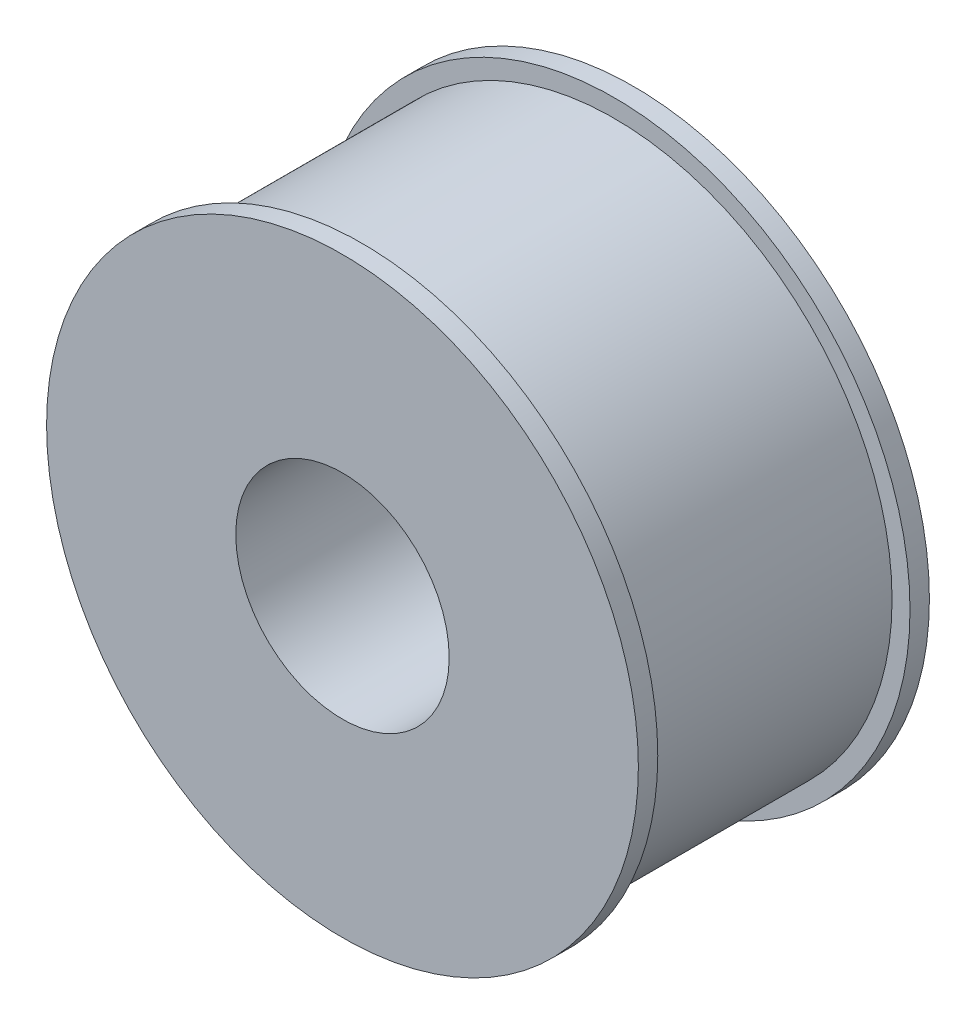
ISO-10303-21;
HEADER;
FILE_DESCRIPTION(('STEP AP214'),'2;1');
FILE_NAME('part.step','',(''),(''),'','','');
FILE_SCHEMA(('AUTOMOTIVE_DESIGN { 1 0 10303 214 1 1 1 1 }'));
ENDSEC;
DATA;
#1=APPLICATION_CONTEXT('core data for automotive mechanical design processes');
#2=APPLICATION_PROTOCOL_DEFINITION('international standard','automotive_design',2000,#1);
#3=PRODUCT_CONTEXT('',#1,'mechanical');
#4=PRODUCT('Part','Part','',(#3));
#5=PRODUCT_RELATED_PRODUCT_CATEGORY('part','',(#4));
#6=PRODUCT_DEFINITION_FORMATION('','',#4);
#7=PRODUCT_DEFINITION_CONTEXT('part definition',#1,'design');
#8=PRODUCT_DEFINITION('design','',#6,#7);
#9=PRODUCT_DEFINITION_SHAPE('','',#8);
#10=(LENGTH_UNIT() NAMED_UNIT(*) SI_UNIT(.MILLI.,.METRE.));
#11=(NAMED_UNIT(*) PLANE_ANGLE_UNIT() SI_UNIT($,.RADIAN.));
#12=(NAMED_UNIT(*) SI_UNIT($,.STERADIAN.) SOLID_ANGLE_UNIT());
#13=UNCERTAINTY_MEASURE_WITH_UNIT(LENGTH_MEASURE(1.E-05),#10,'distance_accuracy_value','');
#14=(GEOMETRIC_REPRESENTATION_CONTEXT(3) GLOBAL_UNCERTAINTY_ASSIGNED_CONTEXT((#13)) GLOBAL_UNIT_ASSIGNED_CONTEXT((#10,
#11,#12)) REPRESENTATION_CONTEXT('',''));
#15=CARTESIAN_POINT('',(0.,0.,0.));
#16=DIRECTION('',(0.,0.,1.));
#17=DIRECTION('',(1.,0.,0.));
#18=AXIS2_PLACEMENT_3D('',#15,#16,#17);
#19=CARTESIAN_POINT('',(0.,0.,0.));
#20=DIRECTION('',(0.,0.,-1.));
#21=DIRECTION('',(-1.,0.,0.));
#22=AXIS2_PLACEMENT_3D('',#19,#20,#21);
#23=PLANE('',#22);
#24=CARTESIAN_POINT('',(0.,0.,0.));
#25=DIRECTION('',(0.,0.,-1.));
#26=DIRECTION('',(-1.,0.,0.));
#27=AXIS2_PLACEMENT_3D('',#24,#25,#26);
#28=CIRCLE('',#27,11.);
#29=CARTESIAN_POINT('',(-11.,0.,0.));
#30=VERTEX_POINT('',#29);
#31=EDGE_CURVE('E70',#30,#30,#28,.T.);
#32=ORIENTED_EDGE('',*,*,#31,.T.);
#33=EDGE_LOOP('',(#32));
#34=FACE_BOUND('',#33,.T.);
#35=CARTESIAN_POINT('',(0.,0.,0.));
#36=DIRECTION('',(0.,0.,1.));
#37=DIRECTION('',(1.,0.,0.));
#38=AXIS2_PLACEMENT_3D('',#35,#36,#37);
#39=CIRCLE('',#38,30.5);
#40=CARTESIAN_POINT('',(30.5,0.,0.));
#41=VERTEX_POINT('',#40);
#42=EDGE_CURVE('E10',#41,#41,#39,.T.);
#43=ORIENTED_EDGE('',*,*,#42,.T.);
#44=EDGE_LOOP('',(#43));
#45=FACE_BOUND('',#44,.T.);
#46=ADVANCED_FACE('F34',(#34,#45),#23,.F.);
#47=CARTESIAN_POINT('',(0.,0.,18.1621621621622));
#48=DIRECTION('',(0.,0.,1.));
#49=DIRECTION('',(1.,0.,0.));
#50=AXIS2_PLACEMENT_3D('',#47,#48,#49);
#51=CYLINDRICAL_SURFACE('',#50,30.5);
#52=ORIENTED_EDGE('',*,*,#42,.F.);
#53=EDGE_LOOP('',(#52));
#54=FACE_BOUND('',#53,.T.);
#55=CARTESIAN_POINT('',(0.,0.,-2.));
#56=DIRECTION('',(0.,0.,1.));
#57=DIRECTION('',(1.,0.,0.));
#58=AXIS2_PLACEMENT_3D('',#55,#56,#57);
#59=CIRCLE('',#58,30.5);
#60=CARTESIAN_POINT('',(30.5,0.,-2.));
#61=VERTEX_POINT('',#60);
#62=EDGE_CURVE('E46',#61,#61,#59,.T.);
#63=ORIENTED_EDGE('',*,*,#62,.T.);
#64=EDGE_LOOP('',(#63));
#65=FACE_BOUND('',#64,.T.);
#66=ADVANCED_FACE('F106',(#54,#65),#51,.T.);
#67=CARTESIAN_POINT('',(0.,30.5,-2.));
#68=DIRECTION('',(0.,0.,1.));
#69=DIRECTION('',(1.,0.,0.));
#70=AXIS2_PLACEMENT_3D('',#67,#68,#69);
#71=PLANE('',#70);
#72=ORIENTED_EDGE('',*,*,#62,.F.);
#73=EDGE_LOOP('',(#72));
#74=FACE_BOUND('',#73,.T.);
#75=CARTESIAN_POINT('',(0.,0.,-2.));
#76=DIRECTION('',(0.,0.,1.));
#77=DIRECTION('',(1.,0.,0.));
#78=AXIS2_PLACEMENT_3D('',#75,#76,#77);
#79=CIRCLE('',#78,28.65);
#80=CARTESIAN_POINT('',(28.65,0.,-2.));
#81=VERTEX_POINT('',#80);
#82=EDGE_CURVE('E50',#81,#81,#79,.T.);
#83=ORIENTED_EDGE('',*,*,#82,.T.);
#84=EDGE_LOOP('',(#83));
#85=FACE_BOUND('',#84,.T.);
#86=ADVANCED_FACE('F111',(#74,#85),#71,.F.);
#87=CARTESIAN_POINT('',(0.,0.,18.1621621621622));
#88=DIRECTION('',(0.,0.,1.));
#89=DIRECTION('',(1.,0.,0.));
#90=AXIS2_PLACEMENT_3D('',#87,#88,#89);
#91=CYLINDRICAL_SURFACE('',#90,28.65);
#92=ORIENTED_EDGE('',*,*,#82,.F.);
#93=EDGE_LOOP('',(#92));
#94=FACE_BOUND('',#93,.T.);
#95=CARTESIAN_POINT('',(0.,0.,-28.));
#96=DIRECTION('',(0.,0.,1.));
#97=DIRECTION('',(1.,0.,0.));
#98=AXIS2_PLACEMENT_3D('',#95,#96,#97);
#99=CIRCLE('',#98,28.65);
#100=CARTESIAN_POINT('',(28.65,0.,-28.));
#101=VERTEX_POINT('',#100);
#102=EDGE_CURVE('E55',#101,#101,#99,.T.);
#103=ORIENTED_EDGE('',*,*,#102,.T.);
#104=EDGE_LOOP('',(#103));
#105=FACE_BOUND('',#104,.T.);
#106=ADVANCED_FACE('F119',(#94,#105),#91,.T.);
#107=CARTESIAN_POINT('',(0.,28.65,-28.));
#108=DIRECTION('',(0.,0.,-1.));
#109=DIRECTION('',(-1.,0.,0.));
#110=AXIS2_PLACEMENT_3D('',#107,#108,#109);
#111=PLANE('',#110);
#112=ORIENTED_EDGE('',*,*,#102,.F.);
#113=EDGE_LOOP('',(#112));
#114=FACE_BOUND('',#113,.T.);
#115=CARTESIAN_POINT('',(0.,0.,-28.));
#116=DIRECTION('',(0.,0.,1.));
#117=DIRECTION('',(1.,0.,0.));
#118=AXIS2_PLACEMENT_3D('',#115,#116,#117);
#119=CIRCLE('',#118,30.5);
#120=CARTESIAN_POINT('',(30.5,0.,-28.));
#121=VERTEX_POINT('',#120);
#122=EDGE_CURVE('E58',#121,#121,#119,.T.);
#123=ORIENTED_EDGE('',*,*,#122,.T.);
#124=EDGE_LOOP('',(#123));
#125=FACE_BOUND('',#124,.T.);
#126=ADVANCED_FACE('F126',(#114,#125),#111,.F.);
#127=CARTESIAN_POINT('',(0.,0.,18.1621621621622));
#128=DIRECTION('',(0.,0.,1.));
#129=DIRECTION('',(1.,0.,0.));
#130=AXIS2_PLACEMENT_3D('',#127,#128,#129);
#131=CYLINDRICAL_SURFACE('',#130,30.5);
#132=ORIENTED_EDGE('',*,*,#122,.F.);
#133=EDGE_LOOP('',(#132));
#134=FACE_BOUND('',#133,.T.);
#135=CARTESIAN_POINT('',(0.,0.,-30.));
#136=DIRECTION('',(0.,0.,1.));
#137=DIRECTION('',(1.,0.,0.));
#138=AXIS2_PLACEMENT_3D('',#135,#136,#137);
#139=CIRCLE('',#138,30.5);
#140=CARTESIAN_POINT('',(30.5,0.,-30.));
#141=VERTEX_POINT('',#140);
#142=EDGE_CURVE('E61',#141,#141,#139,.T.);
#143=ORIENTED_EDGE('',*,*,#142,.T.);
#144=EDGE_LOOP('',(#143));
#145=FACE_BOUND('',#144,.T.);
#146=ADVANCED_FACE('F130',(#134,#145),#131,.T.);
#147=CARTESIAN_POINT('',(0.,30.5,-30.));
#148=DIRECTION('',(0.,0.,1.));
#149=DIRECTION('',(1.,0.,0.));
#150=AXIS2_PLACEMENT_3D('',#147,#148,#149);
#151=PLANE('',#150);
#152=ORIENTED_EDGE('',*,*,#142,.F.);
#153=EDGE_LOOP('',(#152));
#154=FACE_BOUND('',#153,.T.);
#155=CARTESIAN_POINT('',(0.,0.,-30.));
#156=DIRECTION('',(0.,0.,1.));
#157=DIRECTION('',(1.,0.,0.));
#158=AXIS2_PLACEMENT_3D('',#155,#156,#157);
#159=CIRCLE('',#158,19.);
#160=CARTESIAN_POINT('',(19.,0.,-30.));
#161=VERTEX_POINT('',#160);
#162=EDGE_CURVE('E64',#161,#161,#159,.T.);
#163=ORIENTED_EDGE('',*,*,#162,.T.);
#164=EDGE_LOOP('',(#163));
#165=FACE_BOUND('',#164,.T.);
#166=ADVANCED_FACE('F101',(#154,#165),#151,.F.);
#167=CARTESIAN_POINT('',(0.,0.,18.1621621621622));
#168=DIRECTION('',(0.,0.,1.));
#169=DIRECTION('',(1.,0.,0.));
#170=AXIS2_PLACEMENT_3D('',#167,#168,#169);
#171=CYLINDRICAL_SURFACE('',#170,19.);
#172=CARTESIAN_POINT('',(-19.,0.,-35.1));
#173=CARTESIAN_POINT('',(-18.9999985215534,0.11757322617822,-35.0999949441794));
#174=CARTESIAN_POINT('',(-18.9988971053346,0.235222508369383,-35.0900928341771));
#175=CARTESIAN_POINT('',(-18.9946092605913,0.467254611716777,-35.0507435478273));
#176=CARTESIAN_POINT('',(-18.9914205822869,0.581633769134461,-35.0212752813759));
#177=CARTESIAN_POINT('',(-18.9833178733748,0.803732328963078,-34.943666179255));
#178=CARTESIAN_POINT('',(-18.9784049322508,0.911455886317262,-34.8955371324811));
#179=CARTESIAN_POINT('',(-18.9674018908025,1.11727389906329,-34.7819967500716));
#180=CARTESIAN_POINT('',(-18.9613120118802,1.21537016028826,-34.7165886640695));
#181=CARTESIAN_POINT('',(-18.9486067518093,1.39959820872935,-34.5700419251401));
#182=CARTESIAN_POINT('',(-18.9419894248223,1.48568213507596,-34.4888432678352));
#183=CARTESIAN_POINT('',(-18.9289910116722,1.64303018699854,-34.3131487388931));
#184=CARTESIAN_POINT('',(-18.9226099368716,1.71429360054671,-34.2186522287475));
#185=CARTESIAN_POINT('',(-18.9107869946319,1.84015104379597,-34.0187398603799));
#186=CARTESIAN_POINT('',(-18.9053476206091,1.89470110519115,-33.9132961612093));
#187=CARTESIAN_POINT('',(-18.8960487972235,1.98530261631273,-33.6946749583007));
#188=CARTESIAN_POINT('',(-18.8921893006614,2.02135461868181,-33.5814976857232));
#189=CARTESIAN_POINT('',(-18.8865052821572,2.07379318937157,-33.3511140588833));
#190=CARTESIAN_POINT('',(-18.8846724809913,2.09025978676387,-33.2339261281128));
#191=CARTESIAN_POINT('',(-18.8832238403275,2.10330760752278,-32.9984367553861));
#192=CARTESIAN_POINT('',(-18.8836079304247,2.09988946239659,-32.8801353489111));
#193=CARTESIAN_POINT('',(-18.886542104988,2.0733306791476,-32.6463312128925));
#194=CARTESIAN_POINT('',(-18.8890825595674,2.05027772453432,-32.5308183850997));
#195=CARTESIAN_POINT('',(-18.8960281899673,1.98524029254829,-32.3053112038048));
#196=CARTESIAN_POINT('',(-18.9004333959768,1.94325550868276,-32.1953169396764));
#197=CARTESIAN_POINT('',(-18.9106232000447,1.84145043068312,-31.9836940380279));
#198=CARTESIAN_POINT('',(-18.9164107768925,1.78159155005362,-31.8820841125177));
#199=CARTESIAN_POINT('',(-18.928710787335,1.64576512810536,-31.6903190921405));
#200=CARTESIAN_POINT('',(-18.9352232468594,1.56979701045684,-31.6001644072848));
#201=CARTESIAN_POINT('',(-18.9482821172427,1.40342032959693,-31.4333597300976));
#202=CARTESIAN_POINT('',(-18.9548285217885,1.31293609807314,-31.3567851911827));
#203=CARTESIAN_POINT('',(-18.9671846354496,1.12035757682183,-31.2199003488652));
#204=CARTESIAN_POINT('',(-18.9729943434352,1.01826326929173,-31.1595900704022));
#205=CARTESIAN_POINT('',(-18.9832250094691,0.805308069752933,-31.0569475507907));
#206=CARTESIAN_POINT('',(-18.9876456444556,0.694445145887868,-31.0146194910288));
#207=CARTESIAN_POINT('',(-18.9945969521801,0.467125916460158,-30.9492000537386));
#208=CARTESIAN_POINT('',(-18.9971276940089,0.350669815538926,-30.9261079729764));
#209=CARTESIAN_POINT('',(-19.0000051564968,0.116123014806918,-30.8999125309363));
#210=CARTESIAN_POINT('',(-19.0003632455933,-0.00195593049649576,-30.8967051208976));
#211=CARTESIAN_POINT('',(-18.9988856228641,-0.236969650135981,-30.9100962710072));
#212=CARTESIAN_POINT('',(-18.997049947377,-0.353904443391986,-30.9266945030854));
#213=CARTESIAN_POINT('',(-18.9913982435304,-0.583007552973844,-30.9791394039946));
#214=CARTESIAN_POINT('',(-18.9875872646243,-0.695187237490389,-31.0149370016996));
#215=CARTESIAN_POINT('',(-18.9784121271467,-0.911950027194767,-31.1047138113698));
#216=CARTESIAN_POINT('',(-18.9730479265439,-1.0165329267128,-31.1586935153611));
#217=CARTESIAN_POINT('',(-18.9613372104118,-1.21560160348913,-31.2835578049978));
#218=CARTESIAN_POINT('',(-18.9549867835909,-1.31004452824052,-31.3545103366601));
#219=CARTESIAN_POINT('',(-18.9420277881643,-1.48571772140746,-31.5112092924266));
#220=CARTESIAN_POINT('',(-18.9354192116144,-1.56694758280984,-31.5969561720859));
#221=CARTESIAN_POINT('',(-18.9226541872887,-1.71425322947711,-31.7812655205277));
#222=CARTESIAN_POINT('',(-18.9164998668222,-1.78026045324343,-31.8798829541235));
#223=CARTESIAN_POINT('',(-18.9053736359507,-1.89477488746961,-32.0868646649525));
#224=CARTESIAN_POINT('',(-18.9004017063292,-1.94328238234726,-32.19522878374));
#225=CARTESIAN_POINT('',(-18.8922170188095,-2.02130711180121,-32.4183981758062));
#226=CARTESIAN_POINT('',(-18.8890005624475,-2.05086429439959,-32.5331893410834));
#227=CARTESIAN_POINT('',(-18.8846798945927,-2.09027863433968,-32.7661429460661));
#228=CARTESIAN_POINT('',(-18.883575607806,-2.1001364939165,-32.8843052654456));
#229=CARTESIAN_POINT('',(-18.8836061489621,-2.09986138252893,-33.1199653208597));
#230=CARTESIAN_POINT('',(-18.884728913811,-2.08983611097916,-33.2374631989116));
#231=CARTESIAN_POINT('',(-18.8890612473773,-2.05030602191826,-33.4690940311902));
#232=CARTESIAN_POINT('',(-18.8922708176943,-2.02080118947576,-33.5832269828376));
#233=CARTESIAN_POINT('',(-18.9004116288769,-1.94318083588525,-33.804881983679));
#234=CARTESIAN_POINT('',(-18.9053425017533,-1.89506929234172,-33.9124054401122));
#235=CARTESIAN_POINT('',(-18.9163710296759,-1.78161203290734,-34.117869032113));
#236=CARTESIAN_POINT('',(-18.9224686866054,-1.71626628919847,-34.2158091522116));
#237=CARTESIAN_POINT('',(-18.9351833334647,-1.56979267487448,-34.399877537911));
#238=CARTESIAN_POINT('',(-18.9418028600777,-1.48858446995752,-34.4859417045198));
#239=CARTESIAN_POINT('',(-18.9547924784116,-1.31285475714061,-34.6432655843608));
#240=CARTESIAN_POINT('',(-18.961162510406,-1.21833008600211,-34.7145217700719));
#241=CARTESIAN_POINT('',(-18.9729559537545,-1.01833180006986,-34.8403824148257));
#242=CARTESIAN_POINT('',(-18.9783764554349,-0.912826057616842,-34.8949360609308));
#243=CARTESIAN_POINT('',(-18.9876295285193,-0.694155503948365,-34.9854776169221));
#244=CARTESIAN_POINT('',(-18.9914638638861,-0.580999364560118,-35.0214861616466));
#245=CARTESIAN_POINT('',(-18.9961644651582,-0.389353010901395,-35.0650774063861));
#246=CARTESIAN_POINT('',(-18.9975959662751,-0.312081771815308,-35.0781551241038));
#247=CARTESIAN_POINT('',(-18.9995142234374,-0.15655159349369,-35.0956180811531));
#248=CARTESIAN_POINT('',(-19.0000009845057,-0.0782926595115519,-35.1000033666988));
#249=CARTESIAN_POINT('',(-19.,0.,-35.1));
#250=B_SPLINE_CURVE_WITH_KNOTS('',3,(#172,#173,#174,#175,#176,#177,#178,#179,#180,#181,#182,
#183,#184,#185,#186,#187,#188,#189,#190,#191,#192,#193,#194,#195,#196,#197,#198,#199,#200,#201,
#202,#203,#204,#205,#206,#207,#208,#209,#210,#211,#212,#213,#214,#215,#216,#217,#218,#219,#220,
#221,#222,#223,#224,#225,#226,#227,#228,#229,#230,#231,#232,#233,#234,#235,#236,#237,#238,#239,
#240,#241,#242,#243,#244,#245,#246,#247,#248,#249),.UNSPECIFIED.,.T.,.F.,(4,2,2,2,2,2,2,2,2,2,2,
2,2,2,2,2,2,2,2,2,2,2,2,2,2,2,2,2,2,2,2,2,2,2,2,2,2,2,4),(0.,0.352433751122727,
0.705248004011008,1.05783972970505,1.4103651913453,1.76425739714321,2.11816660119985,
2.47299900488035,2.8278208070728,3.18118771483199,3.53454340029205,3.88632932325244,
4.23812094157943,4.59067756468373,4.94324680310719,5.29771745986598,5.65218866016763,
6.00674224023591,6.36128285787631,6.71396672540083,7.06664475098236,7.41842564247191,
7.77021605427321,8.12343905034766,8.47667292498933,8.83146794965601,9.18625720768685,
9.54029607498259,9.89432232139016,10.2464361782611,10.5985503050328,10.9505892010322,
11.3026286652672,11.656499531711,12.0104546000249,12.3654760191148,12.7201015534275,
12.9547903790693,13.189477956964),.UNSPECIFIED.);
#251=CARTESIAN_POINT('',(-19.,0.,-35.1));
#252=VERTEX_POINT('',#251);
#253=EDGE_CURVE('E74',#252,#252,#250,.T.);
#254=ORIENTED_EDGE('',*,*,#253,.T.);
#255=EDGE_LOOP('',(#254));
#256=FACE_BOUND('',#255,.T.);
#257=ORIENTED_EDGE('',*,*,#162,.F.);
#258=EDGE_LOOP('',(#257));
#259=FACE_BOUND('',#258,.T.);
#260=CARTESIAN_POINT('',(0.,0.,-36.));
#261=DIRECTION('',(0.,0.,1.));
#262=DIRECTION('',(1.,0.,0.));
#263=AXIS2_PLACEMENT_3D('',#260,#261,#262);
#264=CIRCLE('',#263,19.);
#265=CARTESIAN_POINT('',(19.,0.,-36.));
#266=VERTEX_POINT('',#265);
#267=EDGE_CURVE('E67',#266,#266,#264,.T.);
#268=ORIENTED_EDGE('',*,*,#267,.T.);
#269=EDGE_LOOP('',(#268));
#270=FACE_BOUND('',#269,.T.);
#271=ADVANCED_FACE('F82',(#256,#259,#270),#171,.T.);
#272=CARTESIAN_POINT('',(0.,19.,-36.));
#273=DIRECTION('',(0.,0.,1.));
#274=DIRECTION('',(1.,0.,0.));
#275=AXIS2_PLACEMENT_3D('',#272,#273,#274);
#276=PLANE('',#275);
#277=CARTESIAN_POINT('',(0.,0.,-36.));
#278=DIRECTION('',(0.,0.,-1.));
#279=DIRECTION('',(-1.,0.,0.));
#280=AXIS2_PLACEMENT_3D('',#277,#278,#279);
#281=CIRCLE('',#280,11.);
#282=CARTESIAN_POINT('',(-11.,0.,-36.));
#283=VERTEX_POINT('',#282);
#284=EDGE_CURVE('E71',#283,#283,#281,.T.);
#285=ORIENTED_EDGE('',*,*,#284,.F.);
#286=EDGE_LOOP('',(#285));
#287=FACE_BOUND('',#286,.T.);
#288=ORIENTED_EDGE('',*,*,#267,.F.);
#289=EDGE_LOOP('',(#288));
#290=FACE_BOUND('',#289,.T.);
#291=ADVANCED_FACE('F94',(#287,#290),#276,.F.);
#292=CARTESIAN_POINT('',(0.,0.,0.));
#293=DIRECTION('',(0.,0.,-1.));
#294=DIRECTION('',(-1.,0.,0.));
#295=AXIS2_PLACEMENT_3D('',#292,#293,#294);
#296=CYLINDRICAL_SURFACE('',#295,11.);
#297=CARTESIAN_POINT('',(-11.,0.,-30.9));
#298=CARTESIAN_POINT('',(-10.9999978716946,0.116820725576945,-30.9000044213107));
#299=CARTESIAN_POINT('',(-10.998119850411,0.233698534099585,-30.9097808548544));
#300=CARTESIAN_POINT('',(-10.9908091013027,0.464157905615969,-30.9486015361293));
#301=CARTESIAN_POINT('',(-10.9853734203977,0.577736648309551,-30.977661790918));
#302=CARTESIAN_POINT('',(-10.971555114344,0.798231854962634,-31.0541256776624));
#303=CARTESIAN_POINT('',(-10.9631751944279,0.905154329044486,-31.1015124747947));
#304=CARTESIAN_POINT('',(-10.9443823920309,1.10952197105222,-31.2132359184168));
#305=CARTESIAN_POINT('',(-10.9339696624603,1.20696785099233,-31.2775712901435));
#306=CARTESIAN_POINT('',(-10.9121153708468,1.39083315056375,-31.4222118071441));
#307=CARTESIAN_POINT('',(-10.9006636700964,1.47711814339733,-31.5026863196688));
#308=CARTESIAN_POINT('',(-10.8780969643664,1.63504914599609,-31.6769564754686));
#309=CARTESIAN_POINT('',(-10.8669819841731,1.70669408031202,-31.77075309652));
#310=CARTESIAN_POINT('',(-10.846248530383,1.83387383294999,-31.9699594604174));
#311=CARTESIAN_POINT('',(-10.8366431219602,1.88927125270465,-32.0754584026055));
#312=CARTESIAN_POINT('',(-10.8201595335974,1.98150370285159,-32.2944798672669));
#313=CARTESIAN_POINT('',(-10.8132811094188,2.01834039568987,-32.4080016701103));
#314=CARTESIAN_POINT('',(-10.8031324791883,2.07197297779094,-32.6384058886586));
#315=CARTESIAN_POINT('',(-10.7998200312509,2.08900368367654,-32.7552317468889));
#316=CARTESIAN_POINT('',(-10.7970511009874,2.10326984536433,-32.9901260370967));
#317=CARTESIAN_POINT('',(-10.7975942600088,2.10050714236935,-33.1081943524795));
#318=CARTESIAN_POINT('',(-10.8024367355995,2.07545516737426,-33.3405163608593));
#319=CARTESIAN_POINT('',(-10.8066845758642,2.05343348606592,-33.4548001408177));
#320=CARTESIAN_POINT('',(-10.8183768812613,1.99091034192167,-33.6780206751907));
#321=CARTESIAN_POINT('',(-10.8258214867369,1.95040806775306,-33.7869571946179));
#322=CARTESIAN_POINT('',(-10.8431219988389,1.85181340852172,-33.9971707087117));
#323=CARTESIAN_POINT('',(-10.8529925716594,1.79361350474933,-34.0983960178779));
#324=CARTESIAN_POINT('',(-10.8740232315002,1.66135166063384,-34.2897446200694));
#325=CARTESIAN_POINT('',(-10.8851834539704,1.5872880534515,-34.3798667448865));
#326=CARTESIAN_POINT('',(-10.9077598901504,1.42396113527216,-34.5479962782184));
#327=CARTESIAN_POINT('',(-10.9191773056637,1.33446907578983,-34.6257814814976));
#328=CARTESIAN_POINT('',(-10.9408141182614,1.14358963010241,-34.7652692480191));
#329=CARTESIAN_POINT('',(-10.9510335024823,1.04220211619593,-34.8269716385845));
#330=CARTESIAN_POINT('',(-10.9691445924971,0.830173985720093,-34.9325772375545));
#331=CARTESIAN_POINT('',(-10.9770331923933,0.719521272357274,-34.9764567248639));
#332=CARTESIAN_POINT('',(-10.9895700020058,0.492231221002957,-35.0449430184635));
#333=CARTESIAN_POINT('',(-10.994218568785,0.375594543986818,-35.0695519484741));
#334=CARTESIAN_POINT('',(-10.9997023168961,0.14155857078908,-35.098487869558));
#335=CARTESIAN_POINT('',(-11.0005947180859,0.0241982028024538,-35.1031192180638));
#336=CARTESIAN_POINT('',(-10.9986238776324,-0.209619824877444,-35.092785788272));
#337=CARTESIAN_POINT('',(-10.9957608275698,-0.326077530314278,-35.0778220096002));
#338=CARTESIAN_POINT('',(-10.9866364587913,-0.553814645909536,-35.0289760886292));
#339=CARTESIAN_POINT('',(-10.9804029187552,-0.665128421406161,-34.995248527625));
#340=CARTESIAN_POINT('',(-10.9652337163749,-0.880521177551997,-34.910000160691));
#341=CARTESIAN_POINT('',(-10.9562978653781,-0.984599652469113,-34.8584781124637));
#342=CARTESIAN_POINT('',(-10.9365725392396,-1.18386224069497,-34.7384337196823));
#343=CARTESIAN_POINT('',(-10.9257632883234,-1.27893275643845,-34.6697261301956));
#344=CARTESIAN_POINT('',(-10.9035399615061,-1.45630391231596,-34.5175109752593));
#345=CARTESIAN_POINT('',(-10.8921258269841,-1.53860331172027,-34.4340019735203));
#346=CARTESIAN_POINT('',(-10.8697885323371,-1.68925742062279,-34.2531745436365));
#347=CARTESIAN_POINT('',(-10.8588743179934,-1.75740408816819,-34.1556814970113));
#348=CARTESIAN_POINT('',(-10.8389551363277,-1.87635388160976,-33.9504531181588));
#349=CARTESIAN_POINT('',(-10.8299500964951,-1.92715766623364,-33.842718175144));
#350=CARTESIAN_POINT('',(-10.8149396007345,-2.00968750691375,-33.6205830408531));
#351=CARTESIAN_POINT('',(-10.8089194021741,-2.04150748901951,-33.5062187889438));
#352=CARTESIAN_POINT('',(-10.8005271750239,-2.08545491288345,-33.2736410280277));
#353=CARTESIAN_POINT('',(-10.7981547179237,-2.09758466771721,-33.155427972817));
#354=CARTESIAN_POINT('',(-10.7973488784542,-2.10172771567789,-32.9205934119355));
#355=CARTESIAN_POINT('',(-10.7988512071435,-2.09406932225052,-32.8039777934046));
#356=CARTESIAN_POINT('',(-10.8054828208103,-2.0595738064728,-32.5737290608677));
#357=CARTESIAN_POINT('',(-10.8106120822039,-2.03273680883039,-32.4600959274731));
#358=CARTESIAN_POINT('',(-10.8238920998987,-1.96078655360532,-32.2392230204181));
#359=CARTESIAN_POINT('',(-10.8320367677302,-1.91571010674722,-32.1319708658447));
#360=CARTESIAN_POINT('',(-10.8504339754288,-1.80859687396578,-31.9264994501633));
#361=CARTESIAN_POINT('',(-10.8606866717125,-1.74655882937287,-31.8282808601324));
#362=CARTESIAN_POINT('',(-10.882343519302,-1.60614737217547,-31.6420226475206));
#363=CARTESIAN_POINT('',(-10.8937630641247,-1.52753550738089,-31.5541645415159));
#364=CARTESIAN_POINT('',(-10.9163530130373,-1.35670385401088,-31.3927774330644));
#365=CARTESIAN_POINT('',(-10.9275233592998,-1.26448094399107,-31.3192517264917));
#366=CARTESIAN_POINT('',(-10.9484794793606,-1.06800710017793,-31.1879698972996));
#367=CARTESIAN_POINT('',(-10.9582512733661,-0.963651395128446,-31.1303682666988));
#368=CARTESIAN_POINT('',(-10.9751724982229,-0.746588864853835,-31.0336079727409));
#369=CARTESIAN_POINT('',(-10.9823243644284,-0.633889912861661,-30.994432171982));
#370=CARTESIAN_POINT('',(-10.9917600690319,-0.434066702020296,-30.943492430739));
#371=CARTESIAN_POINT('',(-10.9948324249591,-0.348102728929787,-30.9272109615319));
#372=CARTESIAN_POINT('',(-10.9989531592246,-0.174769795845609,-30.9054632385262));
#373=CARTESIAN_POINT('',(-11.0000015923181,-0.0874008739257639,-30.8999966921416));
#374=CARTESIAN_POINT('',(-11.,0.,-30.9));
#375=B_SPLINE_CURVE_WITH_KNOTS('',3,(#297,#298,#299,#300,#301,#302,#303,#304,#305,#306,#307,
#308,#309,#310,#311,#312,#313,#314,#315,#316,#317,#318,#319,#320,#321,#322,#323,#324,#325,#326,
#327,#328,#329,#330,#331,#332,#333,#334,#335,#336,#337,#338,#339,#340,#341,#342,#343,#344,#345,
#346,#347,#348,#349,#350,#351,#352,#353,#354,#355,#356,#357,#358,#359,#360,#361,#362,#363,#364,
#365,#366,#367,#368,#369,#370,#371,#372,#373,#374),.UNSPECIFIED.,.T.,.F.,(4,2,2,2,2,2,2,2,2,2,2,
2,2,2,2,2,2,2,2,2,2,2,2,2,2,2,2,2,2,2,2,2,2,2,2,2,2,2,4),(0.,0.350142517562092,
0.700576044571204,1.05068842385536,1.40077447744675,1.75474719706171,2.10874590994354,
2.46565720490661,2.82253652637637,3.17514016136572,3.52771099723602,3.87545955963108,
4.22322339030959,4.5731437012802,4.92310079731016,5.27878057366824,5.63446416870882,
5.99061961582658,6.3467358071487,6.69740698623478,7.04806027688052,7.39586667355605,
7.7436973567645,8.09545238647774,8.44724156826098,8.80388396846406,9.16051282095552,
9.51536222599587,9.87016994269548,10.2191288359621,10.5680854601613,10.9163413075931,
11.2646230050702,11.6183069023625,11.9720720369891,12.3291576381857,12.6859104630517,
12.9478810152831,13.2098444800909),.UNSPECIFIED.);
#376=CARTESIAN_POINT('',(-11.,0.,-30.9));
#377=VERTEX_POINT('',#376);
#378=EDGE_CURVE('E37',#377,#377,#375,.T.);
#379=ORIENTED_EDGE('',*,*,#378,.T.);
#380=EDGE_LOOP('',(#379));
#381=FACE_BOUND('',#380,.T.);
#382=ORIENTED_EDGE('',*,*,#31,.F.);
#383=EDGE_LOOP('',(#382));
#384=FACE_BOUND('',#383,.T.);
#385=ORIENTED_EDGE('',*,*,#284,.T.);
#386=EDGE_LOOP('',(#385));
#387=FACE_BOUND('',#386,.T.);
#388=ADVANCED_FACE('F89',(#381,#384,#387),#296,.F.);
#389=CARTESIAN_POINT('',(-30.5,0.,-33.));
#390=DIRECTION('',(1.,0.,0.));
#391=DIRECTION('',(0.,0.,-1.));
#392=AXIS2_PLACEMENT_3D('',#389,#390,#391);
#393=CYLINDRICAL_SURFACE('',#392,2.1);
#394=ORIENTED_EDGE('',*,*,#378,.F.);
#395=EDGE_LOOP('',(#394));
#396=FACE_BOUND('',#395,.T.);
#397=ORIENTED_EDGE('',*,*,#253,.F.);
#398=EDGE_LOOP('',(#397));
#399=FACE_BOUND('',#398,.T.);
#400=ADVANCED_FACE('F86',(#396,#399),#393,.F.);
#401=CLOSED_SHELL('',(#46,#66,#86,#106,#126,#146,#166,#271,#291,#388,#400));
#402=MANIFOLD_SOLID_BREP('B2',#401);
#403=ADVANCED_BREP_SHAPE_REPRESENTATION('',(#18,#402),#14);
#404=SHAPE_DEFINITION_REPRESENTATION(#9,#403);
ENDSEC;
END-ISO-10303-21;
